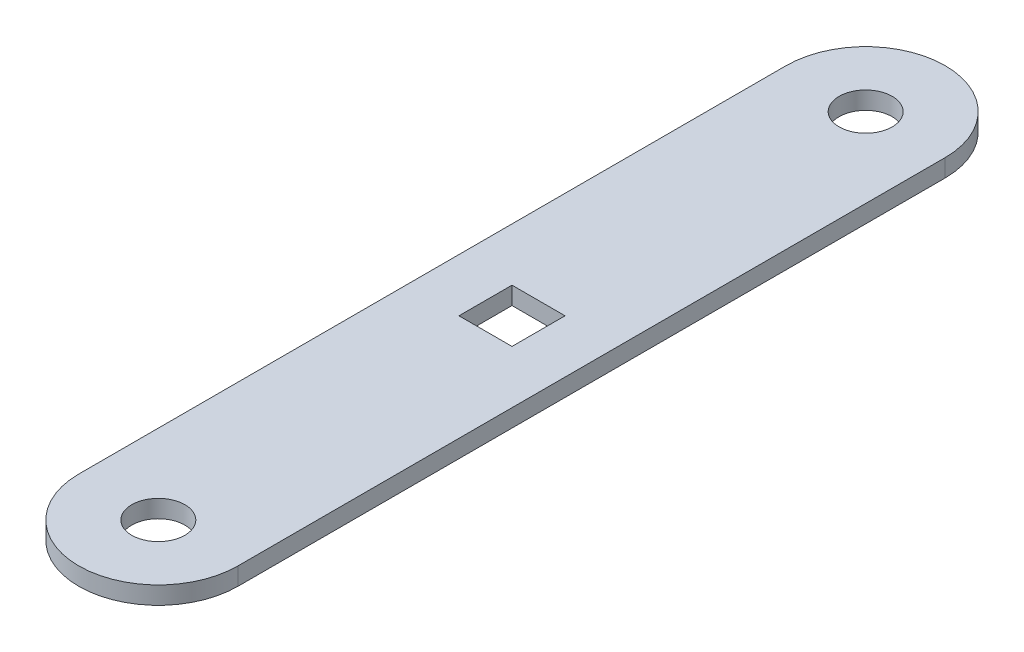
from build123d import *

# Parameters (mm, degrees)
SKETCH1_W           = 450
SKETCH1_H           = 2000
BOSS_EXTRUDE1_DEPTH = 50
CUT_EXTRUDE2_DEPTH  = 250
CUT_EXTRUDE4_DEPTH  = 1247.495086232
SKETCH4_W           = 150
SKETCH4_H           = 150
CUT_EXTRUDE5_DEPTH  = 1247.495086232


with BuildPart() as part:
    # Sketch1 → Boss-Extrude1 (new body)
    with BuildSketch(Plane(origin=(0, 0, 0), x_dir=(1, 0, 0), z_dir=(0, 1, 0))):
        Rectangle(SKETCH1_W, SKETCH1_H)
        with BuildLine():
            Line((-225, 1000), (225, 1000))
            ThreePointArc((225, 1000), (0, 1225), (-225, 1000))
        make_face()
        with BuildLine():
            ThreePointArc((225, -1000), (0, -1225), (-225, -1000))
            Line((-225, -1000), (225, -1000))
        make_face()
    extrude(amount=BOSS_EXTRUDE1_DEPTH)

    # Sketch3 → Cut-Extrude2 (cut)
    with BuildSketch(Plane(origin=(0, 50, 0), x_dir=(1, 0, 0), z_dir=(0, 1, 0))):
        with BuildLine():
            ThreePointArc((75, 1000), (0, 1075), (-75, 1000))
            Line((-75, 1000), (75, 1000))
        make_face()
        with BuildLine():
            Line((75, 1000), (-75, 1000))
            ThreePointArc((-75, 1000), (0, 925), (75, 1000))
        make_face()
        with BuildLine():
            ThreePointArc((75, 1000), (0, 1075), (-75, 1000))
            Line((-75, 1000), (75, 1000))
        make_face()
        with BuildLine():
            Line((75, 1000), (-75, 1000))
            ThreePointArc((-75, 1000), (0, 925), (75, 1000))
        make_face()
    extrude(amount=-CUT_EXTRUDE2_DEPTH, mode=Mode.SUBTRACT)

    # Sketch2 → Cut-Extrude4 (cut, through all)
    with BuildSketch(Plane(origin=(0, 50, 0), x_dir=(1, 0, 0), z_dir=(0, 1, 0))):
        with BuildLine():
            ThreePointArc((75, -1000), (0, -925), (-75, -1000))
            Line((-75, -1000), (75, -1000))
        make_face()
        with BuildLine():
            Line((75, -1000), (-75, -1000))
            ThreePointArc((-75, -1000), (0, -1075), (75, -1000))
        make_face()
        with BuildLine():
            ThreePointArc((75, -1000), (0, -925), (-75, -1000))
            Line((-75, -1000), (75, -1000))
        make_face()
        with BuildLine():
            Line((75, -1000), (-75, -1000))
            ThreePointArc((-75, -1000), (0, -1075), (75, -1000))
        make_face()
    extrude(amount=-CUT_EXTRUDE4_DEPTH, mode=Mode.SUBTRACT)

    # Sketch4 → Cut-Extrude5 (cut, through all)
    with BuildSketch(Plane(origin=(0, 50, 0), x_dir=(1, 0, 0), z_dir=(0, 1, 0))):
        Rectangle(SKETCH4_W, SKETCH4_H)
    extrude(amount=-CUT_EXTRUDE5_DEPTH, mode=Mode.SUBTRACT)


solid = part.part
